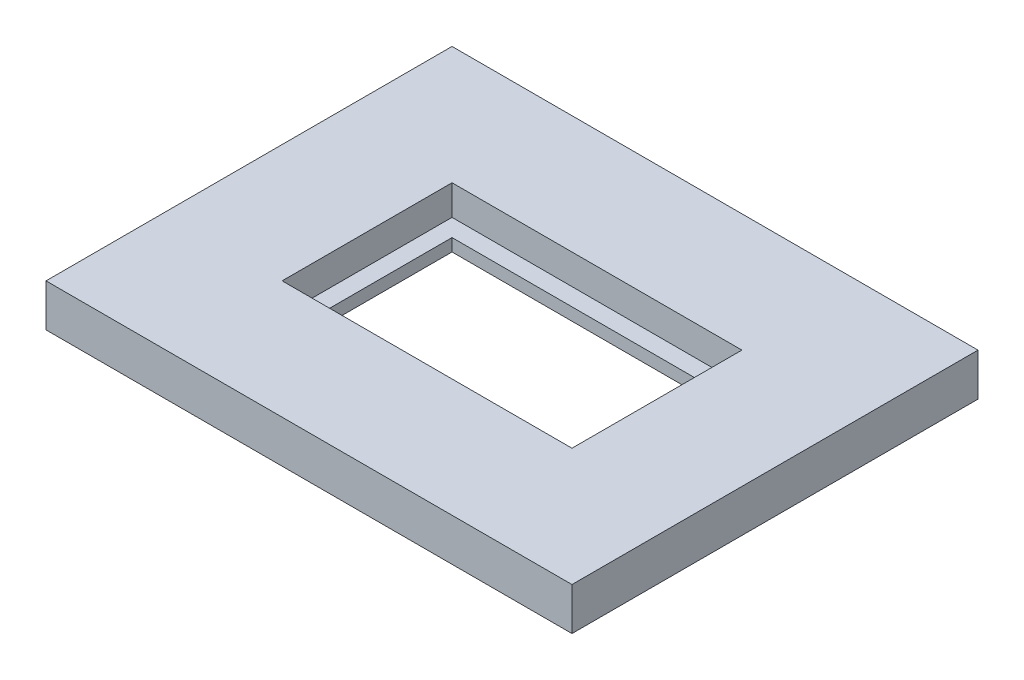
from build123d import *

# Parameters (mm, degrees)
SKETCH1_W           = 334.15
SKETCH1_H           = 257.95
SKETCH1_W_2         = 184.15
SKETCH1_H_2         = 107.95
BOSS_EXTRUDE1_DEPTH = 19.05
SKETCH2_W           = 334.15
SKETCH2_H           = 257.95
SKETCH2_W_2         = 161.925
SKETCH2_H_2         = 85.725
BOSS_EXTRUDE2_DEPTH = 7.9375


with BuildPart() as part:
    # Sketch1 → Boss-Extrude1 (new body)
    with BuildSketch(Plane(origin=(0, 0, 0), x_dir=(1, 0, 0), z_dir=(0, 1, 0))):
        Rectangle(SKETCH1_W, SKETCH1_H)
        Rectangle(SKETCH1_W_2, SKETCH1_H_2, mode=Mode.SUBTRACT)
    extrude(amount=BOSS_EXTRUDE1_DEPTH)

    # Sketch2 → Boss-Extrude2 (add)
    with BuildSketch(Plane.XZ):
        Rectangle(SKETCH2_W, SKETCH2_H)
        Rectangle(SKETCH2_W_2, SKETCH2_H_2, mode=Mode.SUBTRACT)
    extrude(amount=BOSS_EXTRUDE2_DEPTH)


solid = part.part
